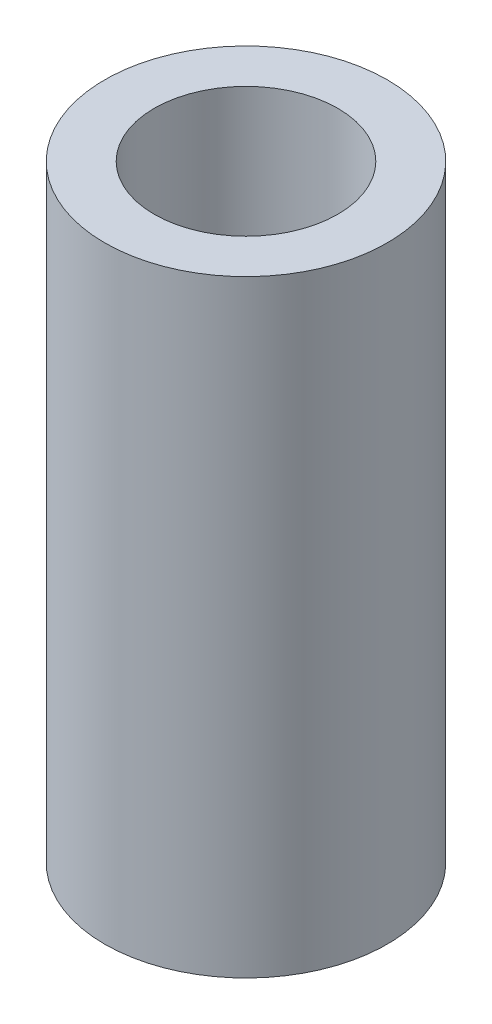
from build123d import *

# Parameters (mm, degrees)
SKIZZE1_R               = 20
SKIZZE1_R_2             = 13
LINEAR_AUSTRAGEN1_DEPTH = 86


with BuildPart() as part:
    # Skizze1 → Linear austragen1 (new body)
    with BuildSketch(Plane(origin=(0, 0, 0), x_dir=(1, 0, 0), z_dir=(0, 1, 0))):
        with Locations(Location((0, 0, 0), (0, 0, 270))):
            Circle(SKIZZE1_R)
        with Locations(Location((0, 0, 0), (0, 0, 270))):
            Circle(SKIZZE1_R_2, mode=Mode.SUBTRACT)
    extrude(amount=LINEAR_AUSTRAGEN1_DEPTH)


solid = part.part
